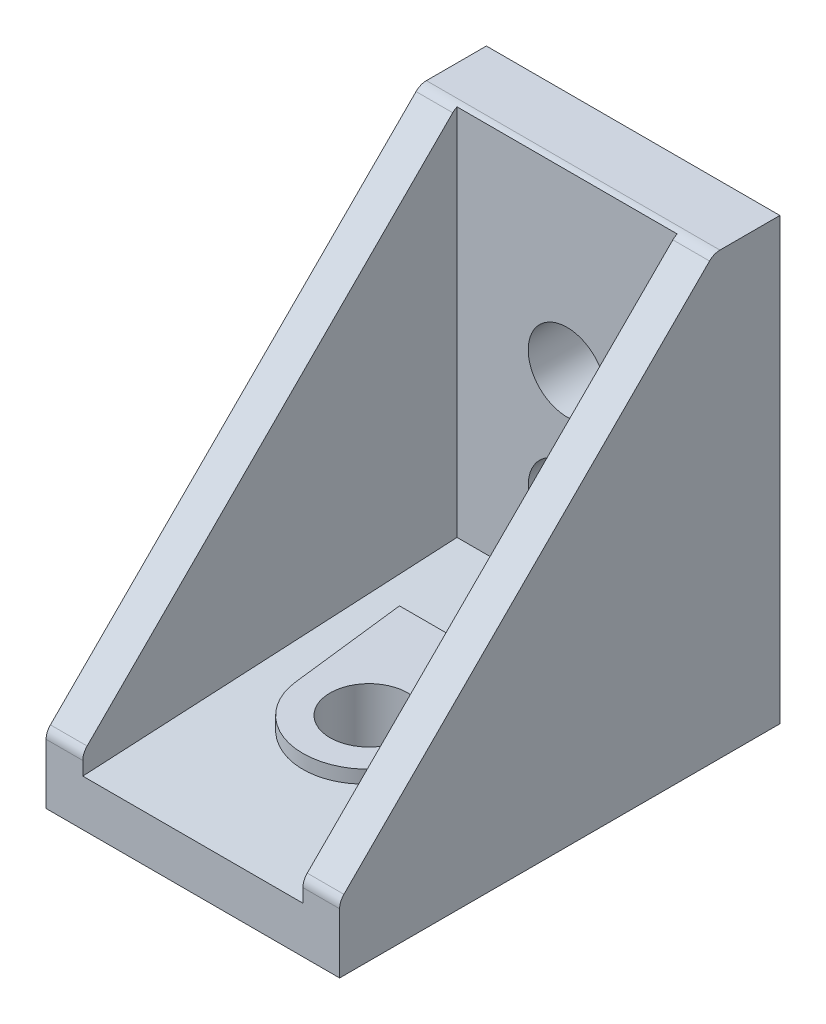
from build123d import *
from build123d.topology import SkipClean

# Parameters (mm, degrees)
BOSS_EXTRUDE1_DEPTH      = 10
BOSS_EXTRUDE1_DEPTH_BACK = 10
CUT_EXTRUDE1_DEPTH       = 7.5
CUT_EXTRUDE1_DEPTH_BACK  = 7.5
BOSS_EXTRUDE2_DEPTH      = 2.25
SKETCH4_R                = 2.65
CUT_EXTRUDE2_DEPTH       = 4.5
SKETCH5_R                = 2.65
CUT_EXTRUDE3_DEPTH       = 4.5
SKETCH6_R                = 2.65
CUT_EXTRUDE4_DEPTH       = 4.5
SKETCH7_W                = 20
SKETCH7_H                = 30
BOSS_EXTRUDE3_DEPTH      = 1
SKETCH8_W                = 20
SKETCH8_H                = 30
CUT_EXTRUDE5_DEPTH       = 1
SKETCH9_W                = 20
SKETCH9_H                = 30
BOSS_EXTRUDE4_DEPTH      = 1
CUT_EXTRUDE6_START       = -1
SKETCH10_W               = 20
SKETCH10_H               = 30
CUT_EXTRUDE6_DEPTH       = 1


with BuildPart() as part:
    # Sketch1 → Boss-Extrude1 (new, two sides: drawn at the far end of the back side and taken through both)
    with BuildSketch(Plane(origin=(0, 0, 0), x_dir=(0, 0, -1), z_dir=(1, 0, 0)).offset(-BOSS_EXTRUDE1_DEPTH_BACK)):
        with BuildLine():
            Line((-30, 0), (0, 0))
            Line((0, 0), (0, 30))
            Line((0, 30), (-4.085786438, 30))
            ThreePointArc((-4.085786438, 30), (-4.46846987, 29.923879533), (-4.792893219, 29.707106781))
            Line((-4.792893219, 29.707106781), (-29.707106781, 4.792893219))
            ThreePointArc((-29.707106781, 4.792893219), (-29.923879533, 4.46846987), (-30, 4.085786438))
            Line((-30, 4.085786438), (-30, 0))
        make_face()
    extrude(amount=BOSS_EXTRUDE1_DEPTH + BOSS_EXTRUDE1_DEPTH_BACK)

    # Sketch2 → Cut-Extrude1 (cut, two sides: drawn at the far end of the back side and taken through both)
    with BuildSketch(Plane(origin=(0, 0, 0), x_dir=(0, 0, -1), z_dir=(1, 0, 0)).offset(-CUT_EXTRUDE1_DEPTH_BACK)):
        Polygon((-34.5, 2.927766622), (-4.5, 4.5), (-4.5, 34.5), (-34.5, 34.5), align=None)
    extrude(amount=CUT_EXTRUDE1_DEPTH + CUT_EXTRUDE1_DEPTH_BACK, mode=Mode.SUBTRACT)

    # Sketch3 → Boss-Extrude2 (add)
    with BuildSketch(Plane(origin=(0, 4.5, 0), x_dir=(1, 0, 0), z_dir=(0, 1, 0))):
        with BuildLine():
            Line((-5.420884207, -10.5), (-4.4686916, -18.529901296))
            ThreePointArc((-4.4686916, -18.529901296), (0, -22.5), (4.4686916, -18.529901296))
            Line((4.4686916, -18.529901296), (5.420884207, -10.5))
            Line((5.420884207, -10.5), (-5.420884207, -10.5))
        make_face()
    extrude(amount=-BOSS_EXTRUDE2_DEPTH)

    # Sketch4 → Cut-Extrude2 (cut)
    with BuildSketch(Plane.XY):
        with Locations((0, 18)):
            Circle(SKETCH4_R)
    extrude(amount=CUT_EXTRUDE2_DEPTH, mode=Mode.SUBTRACT)

    # Sketch5 → Cut-Extrude3 (cut)
    with BuildSketch(Plane.XY):
        with Locations((0, 10)):
            Circle(SKETCH5_R)
    extrude(amount=CUT_EXTRUDE3_DEPTH, mode=Mode.SUBTRACT)

    # Sketch6 → Cut-Extrude4 (cut)
    with BuildSketch(Plane(origin=(0, 0, 0), x_dir=(1, 0, 0), z_dir=(0, 1, 0))):
        with Locations(Location((0, -18, 0), (0, 0, 270))):
            Circle(SKETCH6_R)
    extrude(amount=CUT_EXTRUDE4_DEPTH, mode=Mode.SUBTRACT)

    # Sketch7 → Boss-Extrude3 (add)
    with BuildSketch(Plane(origin=(0, 0, 0), x_dir=(1, 0, 0), z_dir=(0, 1, 0))):
        with Locations((0, -15)):
            Rectangle(SKETCH7_W, SKETCH7_H)
    extrude(amount=-BOSS_EXTRUDE3_DEPTH)

    # Sketch8 → Cut-Extrude5 (cut)
    with BuildSketch(Plane(origin=(0, 0, 0), x_dir=(1, 0, 0), z_dir=(0, 1, 0))):
        with Locations((0, -15)):
            Rectangle(SKETCH8_W, SKETCH8_H)
        with BuildLine():
            Line((-2.7, -11), (2.7, -11))
            ThreePointArc((2.7, -11), (2.912132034, -10.912132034), (3, -10.7))
            Line((3, -10.7), (3, -5.3))
            ThreePointArc((3, -5.3), (2.912132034, -5.087867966), (2.7, -5))
            Line((2.7, -5), (-2.7, -5))
            ThreePointArc((-2.7, -5), (-2.912132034, -5.087867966), (-3, -5.3))
            Line((-3, -5.3), (-3, -10.7))
            ThreePointArc((-3, -10.7), (-2.912132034, -10.912132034), (-2.7, -11))
        make_face(mode=Mode.SUBTRACT)
        with BuildLine():
            Line((-2.7, -27), (2.7, -27))
            ThreePointArc((2.7, -27), (2.912132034, -26.912132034), (3, -26.7))
            Line((3, -26.7), (3, -24.3))
            ThreePointArc((3, -24.3), (2.912132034, -24.087867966), (2.7, -24))
            Line((2.7, -24), (-2.7, -24))
            ThreePointArc((-2.7, -24), (-2.912132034, -24.087867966), (-3, -24.3))
            Line((-3, -24.3), (-3, -26.7))
            ThreePointArc((-3, -26.7), (-2.912132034, -26.912132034), (-2.7, -27))
        make_face(mode=Mode.SUBTRACT)
    extrude(amount=-CUT_EXTRUDE5_DEPTH, mode=Mode.SUBTRACT)

    # Sketch9 → Boss-Extrude4 (add)
    with BuildSketch(Plane.XY):
        with Locations((0, 15)):
            Rectangle(SKETCH9_W, SKETCH9_H)
    extrude(amount=-BOSS_EXTRUDE4_DEPTH)

    # Sketch10 → Cut-Extrude6 (cut)
    with SkipClean():  # the faces are left unmerged after this step: merging them gives an invalid solid
        with BuildSketch(Plane.XY.offset(CUT_EXTRUDE6_START)):
            with Locations((0, 15)):
                Rectangle(SKETCH10_W, SKETCH10_H)
            with BuildLine():
                Line((0.5, 7), (2, 7))
                ThreePointArc((2, 7), (2.707106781, 7.292893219), (3, 8))
                Line((3, 8), (3, 9.5))
                Line((3, 9.5), (2.602402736, 9.5))
                ThreePointArc((2.602402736, 9.5), (1.87383297, 8.12616703), (0.5, 7.397597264))
                Line((0.5, 7.397597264), (0.5, 7))
            make_face(mode=Mode.SUBTRACT)
            with BuildLine():
                Line((0.5, 13), (0.5, 12.602402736))
                ThreePointArc((0.5, 12.602402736), (1.87383297, 11.87383297), (2.602402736, 10.5))
                Line((2.602402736, 10.5), (3, 10.5))
                Line((3, 10.5), (3, 12))
                ThreePointArc((3, 12), (2.707106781, 12.707106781), (2, 13))
                Line((2, 13), (0.5, 13))
            make_face(mode=Mode.SUBTRACT)
            with BuildLine():
                Line((-3, 9.5), (-3, 8))
                ThreePointArc((-3, 8), (-2.707106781, 7.292893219), (-2, 7))
                Line((-2, 7), (-0.5, 7))
                Line((-0.5, 7), (-0.5, 7.397597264))
                ThreePointArc((-0.5, 7.397597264), (-1.87383297, 8.12616703), (-2.602402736, 9.5))
                Line((-2.602402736, 9.5), (-3, 9.5))
            make_face(mode=Mode.SUBTRACT)
            with BuildLine():
                Line((-3, 10.5), (-2.602402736, 10.5))
                ThreePointArc((-2.602402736, 10.5), (-1.87383297, 11.87383297), (-0.5, 12.602402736))
                Line((-0.5, 12.602402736), (-0.5, 13))
                Line((-0.5, 13), (-2, 13))
                ThreePointArc((-2, 13), (-2.707106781, 12.707106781), (-3, 12))
                Line((-3, 12), (-3, 10.5))
            make_face(mode=Mode.SUBTRACT)
        extrude(amount=CUT_EXTRUDE6_DEPTH, mode=Mode.SUBTRACT)


solid = part.part
